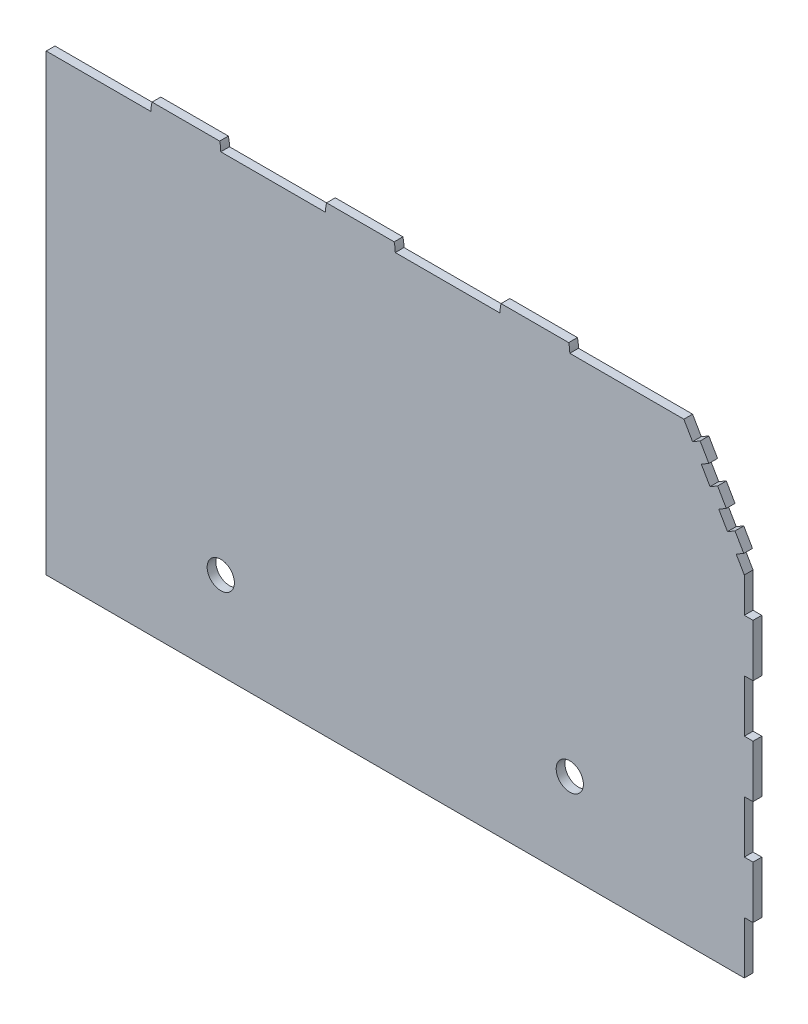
ISO-10303-21;
HEADER;
FILE_DESCRIPTION(('STEP AP214'),'2;1');
FILE_NAME('part.step','',(''),(''),'','','');
FILE_SCHEMA(('AUTOMOTIVE_DESIGN { 1 0 10303 214 1 1 1 1 }'));
ENDSEC;
DATA;
#1=APPLICATION_CONTEXT('core data for automotive mechanical design processes');
#2=APPLICATION_PROTOCOL_DEFINITION('international standard','automotive_design',2000,#1);
#3=PRODUCT_CONTEXT('',#1,'mechanical');
#4=PRODUCT('Part','Part','',(#3));
#5=PRODUCT_RELATED_PRODUCT_CATEGORY('part','',(#4));
#6=PRODUCT_DEFINITION_FORMATION('','',#4);
#7=PRODUCT_DEFINITION_CONTEXT('part definition',#1,'design');
#8=PRODUCT_DEFINITION('design','',#6,#7);
#9=PRODUCT_DEFINITION_SHAPE('','',#8);
#10=(LENGTH_UNIT() NAMED_UNIT(*) SI_UNIT(.MILLI.,.METRE.));
#11=(NAMED_UNIT(*) PLANE_ANGLE_UNIT() SI_UNIT($,.RADIAN.));
#12=(NAMED_UNIT(*) SI_UNIT($,.STERADIAN.) SOLID_ANGLE_UNIT());
#13=UNCERTAINTY_MEASURE_WITH_UNIT(LENGTH_MEASURE(1.E-05),#10,'distance_accuracy_value','');
#14=(GEOMETRIC_REPRESENTATION_CONTEXT(3) GLOBAL_UNCERTAINTY_ASSIGNED_CONTEXT((#13)) GLOBAL_UNIT_ASSIGNED_CONTEXT((#10,
#11,#12)) REPRESENTATION_CONTEXT('',''));
#15=CARTESIAN_POINT('',(0.,0.,0.));
#16=DIRECTION('',(0.,0.,1.));
#17=DIRECTION('',(1.,0.,0.));
#18=AXIS2_PLACEMENT_3D('',#15,#16,#17);
#19=CARTESIAN_POINT('',(50.8,165.1,3.175));
#20=DIRECTION('',(0.,0.,1.));
#21=DIRECTION('',(1.,0.,0.));
#22=AXIS2_PLACEMENT_3D('',#19,#20,#21);
#23=PLANE('',#22);
#24=CARTESIAN_POINT('',(63.5,31.75,3.175));
#25=DIRECTION('',(0.,0.,1.));
#26=DIRECTION('',(1.,0.,0.));
#27=AXIS2_PLACEMENT_3D('',#24,#25,#26);
#28=CIRCLE('',#27,4.953);
#29=CARTESIAN_POINT('',(68.453,31.75,3.175));
#30=VERTEX_POINT('',#29);
#31=EDGE_CURVE('E333',#30,#30,#28,.T.);
#32=ORIENTED_EDGE('',*,*,#31,.F.);
#33=EDGE_LOOP('',(#32));
#34=FACE_BOUND('',#33,.T.);
#35=DIRECTION('',(1.,0.,0.));
#36=VECTOR('',#35,1.);
#37=CARTESIAN_POINT('',(254.,0.,3.175));
#38=LINE('',#37,#36);
#39=CARTESIAN_POINT('',(0.,0.,3.175));
#40=VERTEX_POINT('',#39);
#41=CARTESIAN_POINT('',(254.,0.,3.175));
#42=VERTEX_POINT('',#41);
#43=EDGE_CURVE('E410',#40,#42,#38,.T.);
#44=ORIENTED_EDGE('',*,*,#43,.T.);
#45=DIRECTION('',(0.,1.,0.));
#46=VECTOR('',#45,1.);
#47=CARTESIAN_POINT('',(254.,19.05,3.175));
#48=LINE('',#47,#46);
#49=CARTESIAN_POINT('',(254.,19.05,3.175));
#50=VERTEX_POINT('',#49);
#51=EDGE_CURVE('E193',#42,#50,#48,.T.);
#52=ORIENTED_EDGE('',*,*,#51,.T.);
#53=DIRECTION('',(1.,0.,0.));
#54=VECTOR('',#53,1.);
#55=CARTESIAN_POINT('',(254.,19.05,3.175));
#56=LINE('',#55,#54);
#57=CARTESIAN_POINT('',(257.175,19.05,3.175));
#58=VERTEX_POINT('',#57);
#59=EDGE_CURVE('E524',#50,#58,#56,.T.);
#60=ORIENTED_EDGE('',*,*,#59,.T.);
#61=DIRECTION('',(0.,1.,0.));
#62=VECTOR('',#61,1.);
#63=CARTESIAN_POINT('',(257.175,19.05,3.175));
#64=LINE('',#63,#62);
#65=CARTESIAN_POINT('',(257.175,38.1,3.175));
#66=VERTEX_POINT('',#65);
#67=EDGE_CURVE('E543',#58,#66,#64,.T.);
#68=ORIENTED_EDGE('',*,*,#67,.T.);
#69=DIRECTION('',(-1.,0.,0.));
#70=VECTOR('',#69,1.);
#71=CARTESIAN_POINT('',(257.175,38.1,3.175));
#72=LINE('',#71,#70);
#73=CARTESIAN_POINT('',(254.,38.1,3.175));
#74=VERTEX_POINT('',#73);
#75=EDGE_CURVE('E540',#66,#74,#72,.T.);
#76=ORIENTED_EDGE('',*,*,#75,.T.);
#77=DIRECTION('',(0.,1.,0.));
#78=VECTOR('',#77,1.);
#79=CARTESIAN_POINT('',(254.,57.15,3.175));
#80=LINE('',#79,#78);
#81=CARTESIAN_POINT('',(254.,57.15,3.175));
#82=VERTEX_POINT('',#81);
#83=EDGE_CURVE('E542',#74,#82,#80,.T.);
#84=ORIENTED_EDGE('',*,*,#83,.T.);
#85=DIRECTION('',(1.,0.,0.));
#86=VECTOR('',#85,1.);
#87=CARTESIAN_POINT('',(254.,57.15,3.175));
#88=LINE('',#87,#86);
#89=CARTESIAN_POINT('',(257.175,57.15,3.175));
#90=VERTEX_POINT('',#89);
#91=EDGE_CURVE('E545',#82,#90,#88,.T.);
#92=ORIENTED_EDGE('',*,*,#91,.T.);
#93=DIRECTION('',(0.,1.,0.));
#94=VECTOR('',#93,1.);
#95=CARTESIAN_POINT('',(257.175,57.15,3.175));
#96=LINE('',#95,#94);
#97=CARTESIAN_POINT('',(257.175,76.2,3.175));
#98=VERTEX_POINT('',#97);
#99=EDGE_CURVE('E551',#90,#98,#96,.T.);
#100=ORIENTED_EDGE('',*,*,#99,.T.);
#101=DIRECTION('',(-1.,0.,0.));
#102=VECTOR('',#101,1.);
#103=CARTESIAN_POINT('',(257.175,76.2,3.175));
#104=LINE('',#103,#102);
#105=CARTESIAN_POINT('',(254.,76.2,3.175));
#106=VERTEX_POINT('',#105);
#107=EDGE_CURVE('E553',#98,#106,#104,.T.);
#108=ORIENTED_EDGE('',*,*,#107,.T.);
#109=DIRECTION('',(0.,1.,0.));
#110=VECTOR('',#109,1.);
#111=CARTESIAN_POINT('',(254.,95.25,3.175));
#112=LINE('',#111,#110);
#113=CARTESIAN_POINT('',(254.,95.25,3.175));
#114=VERTEX_POINT('',#113);
#115=EDGE_CURVE('E555',#106,#114,#112,.T.);
#116=ORIENTED_EDGE('',*,*,#115,.T.);
#117=DIRECTION('',(1.,0.,0.));
#118=VECTOR('',#117,1.);
#119=CARTESIAN_POINT('',(254.,95.25,3.175));
#120=LINE('',#119,#118);
#121=CARTESIAN_POINT('',(257.175,95.25,3.175));
#122=VERTEX_POINT('',#121);
#123=EDGE_CURVE('E557',#114,#122,#120,.T.);
#124=ORIENTED_EDGE('',*,*,#123,.T.);
#125=DIRECTION('',(0.,1.,0.));
#126=VECTOR('',#125,1.);
#127=CARTESIAN_POINT('',(257.175,95.25,3.175));
#128=LINE('',#127,#126);
#129=CARTESIAN_POINT('',(257.175,114.3,3.175));
#130=VERTEX_POINT('',#129);
#131=EDGE_CURVE('E559',#122,#130,#128,.T.);
#132=ORIENTED_EDGE('',*,*,#131,.T.);
#133=DIRECTION('',(-1.,0.,0.));
#134=VECTOR('',#133,1.);
#135=CARTESIAN_POINT('',(257.175,114.3,3.175));
#136=LINE('',#135,#134);
#137=CARTESIAN_POINT('',(254.,114.3,3.175));
#138=VERTEX_POINT('',#137);
#139=EDGE_CURVE('E561',#130,#138,#136,.T.);
#140=ORIENTED_EDGE('',*,*,#139,.T.);
#141=DIRECTION('',(0.,1.,0.));
#142=VECTOR('',#141,1.);
#143=CARTESIAN_POINT('',(254.,127.,3.175));
#144=LINE('',#143,#142);
#145=CARTESIAN_POINT('',(254.,127.,3.175));
#146=VERTEX_POINT('',#145);
#147=EDGE_CURVE('E563',#138,#146,#144,.T.);
#148=ORIENTED_EDGE('',*,*,#147,.T.);
#149=DIRECTION('',(-0.500000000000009,0.866025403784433,0.));
#150=VECTOR('',#149,1.);
#151=CARTESIAN_POINT('',(251.052954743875,132.104432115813,3.175));
#152=LINE('',#151,#150);
#153=CARTESIAN_POINT('',(251.052954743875,132.104432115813,3.175));
#154=VERTEX_POINT('',#153);
#155=EDGE_CURVE('E565',#146,#154,#152,.T.);
#156=ORIENTED_EDGE('',*,*,#155,.T.);
#157=DIRECTION('',(0.866025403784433,0.500000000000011,0.));
#158=VECTOR('',#157,1.);
#159=CARTESIAN_POINT('',(253.802585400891,133.691932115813,3.175));
#160=LINE('',#159,#158);
#161=CARTESIAN_POINT('',(253.802585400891,133.691932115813,3.175));
#162=VERTEX_POINT('',#161);
#163=EDGE_CURVE('E567',#154,#162,#160,.T.);
#164=ORIENTED_EDGE('',*,*,#163,.T.);
#165=DIRECTION('',(-0.499999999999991,0.866025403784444,0.));
#166=VECTOR('',#165,1.);
#167=CARTESIAN_POINT('',(250.627585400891,139.191193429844,3.175));
#168=LINE('',#167,#166);
#169=CARTESIAN_POINT('',(250.627585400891,139.191193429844,3.175));
#170=VERTEX_POINT('',#169);
#171=EDGE_CURVE('E569',#162,#170,#168,.T.);
#172=ORIENTED_EDGE('',*,*,#171,.T.);
#173=DIRECTION('',(-0.866025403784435,-0.500000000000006,0.));
#174=VECTOR('',#173,1.);
#175=CARTESIAN_POINT('',(247.877954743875,137.603693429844,3.175));
#176=LINE('',#175,#174);
#177=CARTESIAN_POINT('',(247.877954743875,137.603693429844,3.175));
#178=VERTEX_POINT('',#177);
#179=EDGE_CURVE('E571',#170,#178,#176,.T.);
#180=ORIENTED_EDGE('',*,*,#179,.T.);
#181=DIRECTION('',(-0.500000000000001,0.866025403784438,0.));
#182=VECTOR('',#181,1.);
#183=CARTESIAN_POINT('',(244.702954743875,143.102954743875,3.175));
#184=LINE('',#183,#182);
#185=CARTESIAN_POINT('',(244.702954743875,143.102954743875,3.175));
#186=VERTEX_POINT('',#185);
#187=EDGE_CURVE('E573',#178,#186,#184,.T.);
#188=ORIENTED_EDGE('',*,*,#187,.T.);
#189=DIRECTION('',(0.866025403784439,0.499999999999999,0.));
#190=VECTOR('',#189,1.);
#191=CARTESIAN_POINT('',(247.452585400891,144.690454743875,3.175));
#192=LINE('',#191,#190);
#193=CARTESIAN_POINT('',(247.452585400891,144.690454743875,3.175));
#194=VERTEX_POINT('',#193);
#195=EDGE_CURVE('E575',#186,#194,#192,.T.);
#196=ORIENTED_EDGE('',*,*,#195,.T.);
#197=DIRECTION('',(-0.499999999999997,0.86602540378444,0.));
#198=VECTOR('',#197,1.);
#199=CARTESIAN_POINT('',(244.277585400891,150.189716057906,3.175));
#200=LINE('',#199,#198);
#201=CARTESIAN_POINT('',(244.277585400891,150.189716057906,3.175));
#202=VERTEX_POINT('',#201);
#203=EDGE_CURVE('E577',#194,#202,#200,.T.);
#204=ORIENTED_EDGE('',*,*,#203,.T.);
#205=DIRECTION('',(-0.866025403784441,-0.499999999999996,0.));
#206=VECTOR('',#205,1.);
#207=CARTESIAN_POINT('',(241.527954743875,148.602216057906,3.175));
#208=LINE('',#207,#206);
#209=CARTESIAN_POINT('',(241.527954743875,148.602216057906,3.175));
#210=VERTEX_POINT('',#209);
#211=EDGE_CURVE('E579',#202,#210,#208,.T.);
#212=ORIENTED_EDGE('',*,*,#211,.T.);
#213=DIRECTION('',(-0.500000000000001,0.866025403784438,0.));
#214=VECTOR('',#213,1.);
#215=CARTESIAN_POINT('',(238.352954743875,154.101477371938,3.175));
#216=LINE('',#215,#214);
#217=CARTESIAN_POINT('',(238.352954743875,154.101477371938,3.175));
#218=VERTEX_POINT('',#217);
#219=EDGE_CURVE('E581',#210,#218,#216,.T.);
#220=ORIENTED_EDGE('',*,*,#219,.T.);
#221=DIRECTION('',(0.866025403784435,0.500000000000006,0.));
#222=VECTOR('',#221,1.);
#223=CARTESIAN_POINT('',(241.102585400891,155.688977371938,3.175));
#224=LINE('',#223,#222);
#225=CARTESIAN_POINT('',(241.102585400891,155.688977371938,3.175));
#226=VERTEX_POINT('',#225);
#227=EDGE_CURVE('E583',#218,#226,#224,.T.);
#228=ORIENTED_EDGE('',*,*,#227,.T.);
#229=DIRECTION('',(-0.500000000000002,0.866025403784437,0.));
#230=VECTOR('',#229,1.);
#231=CARTESIAN_POINT('',(237.927585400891,161.188238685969,3.175));
#232=LINE('',#231,#230);
#233=CARTESIAN_POINT('',(237.927585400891,161.188238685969,3.175));
#234=VERTEX_POINT('',#233);
#235=EDGE_CURVE('E585',#226,#234,#232,.T.);
#236=ORIENTED_EDGE('',*,*,#235,.T.);
#237=DIRECTION('',(-0.866025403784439,-0.499999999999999,0.));
#238=VECTOR('',#237,1.);
#239=CARTESIAN_POINT('',(235.177954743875,159.600738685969,3.175));
#240=LINE('',#239,#238);
#241=CARTESIAN_POINT('',(235.177954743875,159.600738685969,3.175));
#242=VERTEX_POINT('',#241);
#243=EDGE_CURVE('E587',#234,#242,#240,.T.);
#244=ORIENTED_EDGE('',*,*,#243,.T.);
#245=DIRECTION('',(-0.500000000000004,0.866025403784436,0.));
#246=VECTOR('',#245,1.);
#247=CARTESIAN_POINT('',(232.002954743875,165.1,3.175));
#248=LINE('',#247,#246);
#249=CARTESIAN_POINT('',(232.002954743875,165.1,3.175));
#250=VERTEX_POINT('',#249);
#251=EDGE_CURVE('E589',#242,#250,#248,.T.);
#252=ORIENTED_EDGE('',*,*,#251,.T.);
#253=DIRECTION('',(-1.,0.,0.));
#254=VECTOR('',#253,1.);
#255=CARTESIAN_POINT('',(190.5,165.1,3.175));
#256=LINE('',#255,#254);
#257=CARTESIAN_POINT('',(190.5,165.1,3.175));
#258=VERTEX_POINT('',#257);
#259=EDGE_CURVE('E591',#250,#258,#256,.T.);
#260=ORIENTED_EDGE('',*,*,#259,.T.);
#261=CARTESIAN_POINT('',(177.8,165.1,3.175));
#262=DIRECTION('',(0.,0.,1.));
#263=DIRECTION('',(1.,0.,0.));
#264=AXIS2_PLACEMENT_3D('',#261,#262,#263);
#265=CIRCLE('',#264,12.7);
#266=CARTESIAN_POINT('',(190.096722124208,168.275,3.175));
#267=VERTEX_POINT('',#266);
#268=EDGE_CURVE('E593',#258,#267,#265,.T.);
#269=ORIENTED_EDGE('',*,*,#268,.T.);
#270=DIRECTION('',(-1.,0.,0.));
#271=VECTOR('',#270,1.);
#272=CARTESIAN_POINT('',(165.503277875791,168.275,3.175));
#273=LINE('',#272,#271);
#274=CARTESIAN_POINT('',(165.503277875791,168.275,3.175));
#275=VERTEX_POINT('',#274);
#276=EDGE_CURVE('E595',#267,#275,#273,.T.);
#277=ORIENTED_EDGE('',*,*,#276,.T.);
#278=CARTESIAN_POINT('',(177.8,165.1,3.175));
#279=DIRECTION('',(0.,0.,1.));
#280=DIRECTION('',(1.,0.,0.));
#281=AXIS2_PLACEMENT_3D('',#278,#279,#280);
#282=CIRCLE('',#281,12.7);
#283=CARTESIAN_POINT('',(165.1,165.1,3.175));
#284=VERTEX_POINT('',#283);
#285=EDGE_CURVE('E597',#275,#284,#282,.T.);
#286=ORIENTED_EDGE('',*,*,#285,.T.);
#287=DIRECTION('',(-1.,0.,0.));
#288=VECTOR('',#287,1.);
#289=CARTESIAN_POINT('',(127.,165.1,3.175));
#290=LINE('',#289,#288);
#291=CARTESIAN_POINT('',(127.,165.1,3.175));
#292=VERTEX_POINT('',#291);
#293=EDGE_CURVE('E599',#284,#292,#290,.T.);
#294=ORIENTED_EDGE('',*,*,#293,.T.);
#295=CARTESIAN_POINT('',(114.3,165.1,3.175));
#296=DIRECTION('',(0.,0.,1.));
#297=DIRECTION('',(1.,0.,0.));
#298=AXIS2_PLACEMENT_3D('',#295,#296,#297);
#299=CIRCLE('',#298,12.7);
#300=CARTESIAN_POINT('',(126.596722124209,168.275,3.175));
#301=VERTEX_POINT('',#300);
#302=EDGE_CURVE('E601',#292,#301,#299,.T.);
#303=ORIENTED_EDGE('',*,*,#302,.T.);
#304=DIRECTION('',(-1.,0.,0.));
#305=VECTOR('',#304,1.);
#306=CARTESIAN_POINT('',(102.003277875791,168.275,3.175));
#307=LINE('',#306,#305);
#308=CARTESIAN_POINT('',(102.003277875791,168.275,3.175));
#309=VERTEX_POINT('',#308);
#310=EDGE_CURVE('E603',#301,#309,#307,.T.);
#311=ORIENTED_EDGE('',*,*,#310,.T.);
#312=CARTESIAN_POINT('',(114.3,165.1,3.175));
#313=DIRECTION('',(0.,0.,1.));
#314=DIRECTION('',(1.,0.,0.));
#315=AXIS2_PLACEMENT_3D('',#312,#313,#314);
#316=CIRCLE('',#315,12.7);
#317=CARTESIAN_POINT('',(101.6,165.1,3.175));
#318=VERTEX_POINT('',#317);
#319=EDGE_CURVE('E605',#309,#318,#316,.T.);
#320=ORIENTED_EDGE('',*,*,#319,.T.);
#321=DIRECTION('',(-1.,0.,0.));
#322=VECTOR('',#321,1.);
#323=CARTESIAN_POINT('',(63.5,165.1,3.175));
#324=LINE('',#323,#322);
#325=CARTESIAN_POINT('',(63.5,165.1,3.175));
#326=VERTEX_POINT('',#325);
#327=EDGE_CURVE('E607',#318,#326,#324,.T.);
#328=ORIENTED_EDGE('',*,*,#327,.T.);
#329=CARTESIAN_POINT('',(50.8,165.1,3.175));
#330=DIRECTION('',(0.,0.,1.));
#331=DIRECTION('',(1.,0.,0.));
#332=AXIS2_PLACEMENT_3D('',#329,#330,#331);
#333=CIRCLE('',#332,12.7);
#334=CARTESIAN_POINT('',(63.0967221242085,168.275,3.175));
#335=VERTEX_POINT('',#334);
#336=EDGE_CURVE('E609',#326,#335,#333,.T.);
#337=ORIENTED_EDGE('',*,*,#336,.T.);
#338=DIRECTION('',(-1.,0.,0.));
#339=VECTOR('',#338,1.);
#340=CARTESIAN_POINT('',(38.5032778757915,168.275,3.175));
#341=LINE('',#340,#339);
#342=CARTESIAN_POINT('',(38.5032778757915,168.275,3.175));
#343=VERTEX_POINT('',#342);
#344=EDGE_CURVE('E311',#335,#343,#341,.T.);
#345=ORIENTED_EDGE('',*,*,#344,.T.);
#346=CARTESIAN_POINT('',(50.8,165.1,3.175));
#347=DIRECTION('',(0.,0.,1.));
#348=DIRECTION('',(1.,0.,0.));
#349=AXIS2_PLACEMENT_3D('',#346,#347,#348);
#350=CIRCLE('',#349,12.7);
#351=CARTESIAN_POINT('',(38.1,165.1,3.175));
#352=VERTEX_POINT('',#351);
#353=EDGE_CURVE('E305',#343,#352,#350,.T.);
#354=ORIENTED_EDGE('',*,*,#353,.T.);
#355=DIRECTION('',(-1.,0.,0.));
#356=VECTOR('',#355,1.);
#357=CARTESIAN_POINT('',(0.,165.1,3.175));
#358=LINE('',#357,#356);
#359=CARTESIAN_POINT('',(0.,165.1,3.175));
#360=VERTEX_POINT('',#359);
#361=EDGE_CURVE('E309',#352,#360,#358,.T.);
#362=ORIENTED_EDGE('',*,*,#361,.T.);
#363=DIRECTION('',(0.,-1.,0.));
#364=VECTOR('',#363,1.);
#365=CARTESIAN_POINT('',(0.,0.,3.175));
#366=LINE('',#365,#364);
#367=EDGE_CURVE('E51',#360,#40,#366,.T.);
#368=ORIENTED_EDGE('',*,*,#367,.T.);
#369=EDGE_LOOP('',(#44,#52,#60,#68,#76,#84,#92,#100,#108,#116,#124,#132,#140,#148,#156,#164,
#172,#180,#188,#196,#204,#212,#220,#228,#236,#244,#252,#260,#269,#277,#286,#294,#303,#311,#320,
#328,#337,#345,#354,#362,#368));
#370=FACE_BOUND('',#369,.T.);
#371=CARTESIAN_POINT('',(190.5,31.75,3.175));
#372=DIRECTION('',(0.,0.,1.));
#373=DIRECTION('',(1.,0.,0.));
#374=AXIS2_PLACEMENT_3D('',#371,#372,#373);
#375=CIRCLE('',#374,4.95299999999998);
#376=CARTESIAN_POINT('',(195.453,31.75,3.175));
#377=VERTEX_POINT('',#376);
#378=EDGE_CURVE('E652',#377,#377,#375,.T.);
#379=ORIENTED_EDGE('',*,*,#378,.F.);
#380=EDGE_LOOP('',(#379));
#381=FACE_BOUND('',#380,.T.);
#382=ADVANCED_FACE('F34',(#34,#370,#381),#23,.T.);
#383=CARTESIAN_POINT('',(50.8,165.1,0.));
#384=DIRECTION('',(0.,0.,1.));
#385=DIRECTION('',(1.,0.,0.));
#386=AXIS2_PLACEMENT_3D('',#383,#384,#385);
#387=PLANE('',#386);
#388=CARTESIAN_POINT('',(63.5,31.75,0.));
#389=DIRECTION('',(0.,0.,1.));
#390=DIRECTION('',(1.,0.,0.));
#391=AXIS2_PLACEMENT_3D('',#388,#389,#390);
#392=CIRCLE('',#391,4.953);
#393=CARTESIAN_POINT('',(68.453,31.75,0.));
#394=VERTEX_POINT('',#393);
#395=EDGE_CURVE('E657',#394,#394,#392,.T.);
#396=ORIENTED_EDGE('',*,*,#395,.T.);
#397=EDGE_LOOP('',(#396));
#398=FACE_BOUND('',#397,.T.);
#399=DIRECTION('',(1.,0.,0.));
#400=VECTOR('',#399,1.);
#401=CARTESIAN_POINT('',(254.,0.,0.));
#402=LINE('',#401,#400);
#403=CARTESIAN_POINT('',(0.,0.,0.));
#404=VERTEX_POINT('',#403);
#405=CARTESIAN_POINT('',(254.,0.,0.));
#406=VERTEX_POINT('',#405);
#407=EDGE_CURVE('E329',#404,#406,#402,.T.);
#408=ORIENTED_EDGE('',*,*,#407,.F.);
#409=DIRECTION('',(0.,-1.,0.));
#410=VECTOR('',#409,1.);
#411=CARTESIAN_POINT('',(0.,0.,0.));
#412=LINE('',#411,#410);
#413=CARTESIAN_POINT('',(0.,165.1,0.));
#414=VERTEX_POINT('',#413);
#415=EDGE_CURVE('E185',#414,#404,#412,.T.);
#416=ORIENTED_EDGE('',*,*,#415,.F.);
#417=DIRECTION('',(-1.,0.,0.));
#418=VECTOR('',#417,1.);
#419=CARTESIAN_POINT('',(0.,165.1,0.));
#420=LINE('',#419,#418);
#421=CARTESIAN_POINT('',(38.1,165.1,0.));
#422=VERTEX_POINT('',#421);
#423=EDGE_CURVE('E179',#422,#414,#420,.T.);
#424=ORIENTED_EDGE('',*,*,#423,.F.);
#425=CARTESIAN_POINT('',(50.8,165.1,0.));
#426=DIRECTION('',(0.,0.,1.));
#427=DIRECTION('',(1.,0.,0.));
#428=AXIS2_PLACEMENT_3D('',#425,#426,#427);
#429=CIRCLE('',#428,12.7);
#430=CARTESIAN_POINT('',(38.5032778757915,168.275,0.));
#431=VERTEX_POINT('',#430);
#432=EDGE_CURVE('E319',#431,#422,#429,.T.);
#433=ORIENTED_EDGE('',*,*,#432,.F.);
#434=DIRECTION('',(-1.,0.,0.));
#435=VECTOR('',#434,1.);
#436=CARTESIAN_POINT('',(38.5032778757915,168.275,0.));
#437=LINE('',#436,#435);
#438=CARTESIAN_POINT('',(63.0967221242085,168.275,0.));
#439=VERTEX_POINT('',#438);
#440=EDGE_CURVE('E405',#439,#431,#437,.T.);
#441=ORIENTED_EDGE('',*,*,#440,.F.);
#442=CARTESIAN_POINT('',(50.8,165.1,0.));
#443=DIRECTION('',(0.,0.,1.));
#444=DIRECTION('',(1.,0.,0.));
#445=AXIS2_PLACEMENT_3D('',#442,#443,#444);
#446=CIRCLE('',#445,12.7);
#447=CARTESIAN_POINT('',(63.5,165.1,0.));
#448=VERTEX_POINT('',#447);
#449=EDGE_CURVE('E403',#448,#439,#446,.T.);
#450=ORIENTED_EDGE('',*,*,#449,.F.);
#451=DIRECTION('',(-1.,0.,0.));
#452=VECTOR('',#451,1.);
#453=CARTESIAN_POINT('',(63.5,165.1,0.));
#454=LINE('',#453,#452);
#455=CARTESIAN_POINT('',(101.6,165.1,0.));
#456=VERTEX_POINT('',#455);
#457=EDGE_CURVE('E401',#456,#448,#454,.T.);
#458=ORIENTED_EDGE('',*,*,#457,.F.);
#459=CARTESIAN_POINT('',(114.3,165.1,0.));
#460=DIRECTION('',(0.,0.,1.));
#461=DIRECTION('',(1.,0.,0.));
#462=AXIS2_PLACEMENT_3D('',#459,#460,#461);
#463=CIRCLE('',#462,12.7);
#464=CARTESIAN_POINT('',(102.003277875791,168.275,0.));
#465=VERTEX_POINT('',#464);
#466=EDGE_CURVE('E399',#465,#456,#463,.T.);
#467=ORIENTED_EDGE('',*,*,#466,.F.);
#468=DIRECTION('',(-1.,0.,0.));
#469=VECTOR('',#468,1.);
#470=CARTESIAN_POINT('',(102.003277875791,168.275,0.));
#471=LINE('',#470,#469);
#472=CARTESIAN_POINT('',(126.596722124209,168.275,0.));
#473=VERTEX_POINT('',#472);
#474=EDGE_CURVE('E397',#473,#465,#471,.T.);
#475=ORIENTED_EDGE('',*,*,#474,.F.);
#476=CARTESIAN_POINT('',(114.3,165.1,0.));
#477=DIRECTION('',(0.,0.,1.));
#478=DIRECTION('',(1.,0.,0.));
#479=AXIS2_PLACEMENT_3D('',#476,#477,#478);
#480=CIRCLE('',#479,12.7);
#481=CARTESIAN_POINT('',(127.,165.1,0.));
#482=VERTEX_POINT('',#481);
#483=EDGE_CURVE('E395',#482,#473,#480,.T.);
#484=ORIENTED_EDGE('',*,*,#483,.F.);
#485=DIRECTION('',(-1.,0.,0.));
#486=VECTOR('',#485,1.);
#487=CARTESIAN_POINT('',(127.,165.1,0.));
#488=LINE('',#487,#486);
#489=CARTESIAN_POINT('',(165.1,165.1,0.));
#490=VERTEX_POINT('',#489);
#491=EDGE_CURVE('E393',#490,#482,#488,.T.);
#492=ORIENTED_EDGE('',*,*,#491,.F.);
#493=CARTESIAN_POINT('',(177.8,165.1,0.));
#494=DIRECTION('',(0.,0.,1.));
#495=DIRECTION('',(1.,0.,0.));
#496=AXIS2_PLACEMENT_3D('',#493,#494,#495);
#497=CIRCLE('',#496,12.7);
#498=CARTESIAN_POINT('',(165.503277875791,168.275,0.));
#499=VERTEX_POINT('',#498);
#500=EDGE_CURVE('E391',#499,#490,#497,.T.);
#501=ORIENTED_EDGE('',*,*,#500,.F.);
#502=DIRECTION('',(-1.,0.,0.));
#503=VECTOR('',#502,1.);
#504=CARTESIAN_POINT('',(165.503277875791,168.275,0.));
#505=LINE('',#504,#503);
#506=CARTESIAN_POINT('',(190.096722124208,168.275,0.));
#507=VERTEX_POINT('',#506);
#508=EDGE_CURVE('E389',#507,#499,#505,.T.);
#509=ORIENTED_EDGE('',*,*,#508,.F.);
#510=CARTESIAN_POINT('',(177.8,165.1,0.));
#511=DIRECTION('',(0.,0.,1.));
#512=DIRECTION('',(1.,0.,0.));
#513=AXIS2_PLACEMENT_3D('',#510,#511,#512);
#514=CIRCLE('',#513,12.7);
#515=CARTESIAN_POINT('',(190.5,165.1,0.));
#516=VERTEX_POINT('',#515);
#517=EDGE_CURVE('E387',#516,#507,#514,.T.);
#518=ORIENTED_EDGE('',*,*,#517,.F.);
#519=DIRECTION('',(-1.,0.,0.));
#520=VECTOR('',#519,1.);
#521=CARTESIAN_POINT('',(190.5,165.1,0.));
#522=LINE('',#521,#520);
#523=CARTESIAN_POINT('',(232.002954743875,165.1,0.));
#524=VERTEX_POINT('',#523);
#525=EDGE_CURVE('E385',#524,#516,#522,.T.);
#526=ORIENTED_EDGE('',*,*,#525,.F.);
#527=DIRECTION('',(-0.500000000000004,0.866025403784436,0.));
#528=VECTOR('',#527,1.);
#529=CARTESIAN_POINT('',(232.002954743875,165.1,0.));
#530=LINE('',#529,#528);
#531=CARTESIAN_POINT('',(235.177954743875,159.600738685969,0.));
#532=VERTEX_POINT('',#531);
#533=EDGE_CURVE('E383',#532,#524,#530,.T.);
#534=ORIENTED_EDGE('',*,*,#533,.F.);
#535=DIRECTION('',(-0.866025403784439,-0.499999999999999,0.));
#536=VECTOR('',#535,1.);
#537=CARTESIAN_POINT('',(235.177954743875,159.600738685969,0.));
#538=LINE('',#537,#536);
#539=CARTESIAN_POINT('',(237.927585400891,161.188238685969,0.));
#540=VERTEX_POINT('',#539);
#541=EDGE_CURVE('E381',#540,#532,#538,.T.);
#542=ORIENTED_EDGE('',*,*,#541,.F.);
#543=DIRECTION('',(-0.500000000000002,0.866025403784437,0.));
#544=VECTOR('',#543,1.);
#545=CARTESIAN_POINT('',(237.927585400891,161.188238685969,0.));
#546=LINE('',#545,#544);
#547=CARTESIAN_POINT('',(241.102585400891,155.688977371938,0.));
#548=VERTEX_POINT('',#547);
#549=EDGE_CURVE('E379',#548,#540,#546,.T.);
#550=ORIENTED_EDGE('',*,*,#549,.F.);
#551=DIRECTION('',(0.866025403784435,0.500000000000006,0.));
#552=VECTOR('',#551,1.);
#553=CARTESIAN_POINT('',(241.102585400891,155.688977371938,0.));
#554=LINE('',#553,#552);
#555=CARTESIAN_POINT('',(238.352954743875,154.101477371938,0.));
#556=VERTEX_POINT('',#555);
#557=EDGE_CURVE('E377',#556,#548,#554,.T.);
#558=ORIENTED_EDGE('',*,*,#557,.F.);
#559=DIRECTION('',(-0.500000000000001,0.866025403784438,0.));
#560=VECTOR('',#559,1.);
#561=CARTESIAN_POINT('',(238.352954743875,154.101477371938,0.));
#562=LINE('',#561,#560);
#563=CARTESIAN_POINT('',(241.527954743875,148.602216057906,0.));
#564=VERTEX_POINT('',#563);
#565=EDGE_CURVE('E375',#564,#556,#562,.T.);
#566=ORIENTED_EDGE('',*,*,#565,.F.);
#567=DIRECTION('',(-0.866025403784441,-0.499999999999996,0.));
#568=VECTOR('',#567,1.);
#569=CARTESIAN_POINT('',(241.527954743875,148.602216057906,0.));
#570=LINE('',#569,#568);
#571=CARTESIAN_POINT('',(244.277585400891,150.189716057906,0.));
#572=VERTEX_POINT('',#571);
#573=EDGE_CURVE('E373',#572,#564,#570,.T.);
#574=ORIENTED_EDGE('',*,*,#573,.F.);
#575=DIRECTION('',(-0.499999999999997,0.86602540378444,0.));
#576=VECTOR('',#575,1.);
#577=CARTESIAN_POINT('',(244.277585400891,150.189716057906,0.));
#578=LINE('',#577,#576);
#579=CARTESIAN_POINT('',(247.452585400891,144.690454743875,0.));
#580=VERTEX_POINT('',#579);
#581=EDGE_CURVE('E371',#580,#572,#578,.T.);
#582=ORIENTED_EDGE('',*,*,#581,.F.);
#583=DIRECTION('',(0.866025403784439,0.499999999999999,0.));
#584=VECTOR('',#583,1.);
#585=CARTESIAN_POINT('',(247.452585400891,144.690454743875,0.));
#586=LINE('',#585,#584);
#587=CARTESIAN_POINT('',(244.702954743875,143.102954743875,0.));
#588=VERTEX_POINT('',#587);
#589=EDGE_CURVE('E369',#588,#580,#586,.T.);
#590=ORIENTED_EDGE('',*,*,#589,.F.);
#591=DIRECTION('',(-0.500000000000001,0.866025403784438,0.));
#592=VECTOR('',#591,1.);
#593=CARTESIAN_POINT('',(244.702954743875,143.102954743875,0.));
#594=LINE('',#593,#592);
#595=CARTESIAN_POINT('',(247.877954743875,137.603693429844,0.));
#596=VERTEX_POINT('',#595);
#597=EDGE_CURVE('E367',#596,#588,#594,.T.);
#598=ORIENTED_EDGE('',*,*,#597,.F.);
#599=DIRECTION('',(-0.866025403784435,-0.500000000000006,0.));
#600=VECTOR('',#599,1.);
#601=CARTESIAN_POINT('',(247.877954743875,137.603693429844,0.));
#602=LINE('',#601,#600);
#603=CARTESIAN_POINT('',(250.627585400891,139.191193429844,0.));
#604=VERTEX_POINT('',#603);
#605=EDGE_CURVE('E365',#604,#596,#602,.T.);
#606=ORIENTED_EDGE('',*,*,#605,.F.);
#607=DIRECTION('',(-0.499999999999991,0.866025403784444,0.));
#608=VECTOR('',#607,1.);
#609=CARTESIAN_POINT('',(250.627585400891,139.191193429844,0.));
#610=LINE('',#609,#608);
#611=CARTESIAN_POINT('',(253.802585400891,133.691932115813,0.));
#612=VERTEX_POINT('',#611);
#613=EDGE_CURVE('E363',#612,#604,#610,.T.);
#614=ORIENTED_EDGE('',*,*,#613,.F.);
#615=DIRECTION('',(0.866025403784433,0.500000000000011,0.));
#616=VECTOR('',#615,1.);
#617=CARTESIAN_POINT('',(253.802585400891,133.691932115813,0.));
#618=LINE('',#617,#616);
#619=CARTESIAN_POINT('',(251.052954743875,132.104432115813,0.));
#620=VERTEX_POINT('',#619);
#621=EDGE_CURVE('E361',#620,#612,#618,.T.);
#622=ORIENTED_EDGE('',*,*,#621,.F.);
#623=DIRECTION('',(-0.500000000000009,0.866025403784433,0.));
#624=VECTOR('',#623,1.);
#625=CARTESIAN_POINT('',(251.052954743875,132.104432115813,0.));
#626=LINE('',#625,#624);
#627=CARTESIAN_POINT('',(254.,127.,0.));
#628=VERTEX_POINT('',#627);
#629=EDGE_CURVE('E359',#628,#620,#626,.T.);
#630=ORIENTED_EDGE('',*,*,#629,.F.);
#631=DIRECTION('',(0.,1.,0.));
#632=VECTOR('',#631,1.);
#633=CARTESIAN_POINT('',(254.,127.,0.));
#634=LINE('',#633,#632);
#635=CARTESIAN_POINT('',(254.,114.3,0.));
#636=VERTEX_POINT('',#635);
#637=EDGE_CURVE('E357',#636,#628,#634,.T.);
#638=ORIENTED_EDGE('',*,*,#637,.F.);
#639=DIRECTION('',(-1.,0.,0.));
#640=VECTOR('',#639,1.);
#641=CARTESIAN_POINT('',(257.175,114.3,0.));
#642=LINE('',#641,#640);
#643=CARTESIAN_POINT('',(257.175,114.3,0.));
#644=VERTEX_POINT('',#643);
#645=EDGE_CURVE('E355',#644,#636,#642,.T.);
#646=ORIENTED_EDGE('',*,*,#645,.F.);
#647=DIRECTION('',(0.,1.,0.));
#648=VECTOR('',#647,1.);
#649=CARTESIAN_POINT('',(257.175,95.25,0.));
#650=LINE('',#649,#648);
#651=CARTESIAN_POINT('',(257.175,95.25,0.));
#652=VERTEX_POINT('',#651);
#653=EDGE_CURVE('E353',#652,#644,#650,.T.);
#654=ORIENTED_EDGE('',*,*,#653,.F.);
#655=DIRECTION('',(1.,0.,0.));
#656=VECTOR('',#655,1.);
#657=CARTESIAN_POINT('',(254.,95.25,0.));
#658=LINE('',#657,#656);
#659=CARTESIAN_POINT('',(254.,95.25,0.));
#660=VERTEX_POINT('',#659);
#661=EDGE_CURVE('E351',#660,#652,#658,.T.);
#662=ORIENTED_EDGE('',*,*,#661,.F.);
#663=DIRECTION('',(0.,1.,0.));
#664=VECTOR('',#663,1.);
#665=CARTESIAN_POINT('',(254.,95.25,0.));
#666=LINE('',#665,#664);
#667=CARTESIAN_POINT('',(254.,76.2,0.));
#668=VERTEX_POINT('',#667);
#669=EDGE_CURVE('E349',#668,#660,#666,.T.);
#670=ORIENTED_EDGE('',*,*,#669,.F.);
#671=DIRECTION('',(-1.,0.,0.));
#672=VECTOR('',#671,1.);
#673=CARTESIAN_POINT('',(257.175,76.2,0.));
#674=LINE('',#673,#672);
#675=CARTESIAN_POINT('',(257.175,76.2,0.));
#676=VERTEX_POINT('',#675);
#677=EDGE_CURVE('E347',#676,#668,#674,.T.);
#678=ORIENTED_EDGE('',*,*,#677,.F.);
#679=DIRECTION('',(0.,1.,0.));
#680=VECTOR('',#679,1.);
#681=CARTESIAN_POINT('',(257.175,57.15,0.));
#682=LINE('',#681,#680);
#683=CARTESIAN_POINT('',(257.175,57.15,0.));
#684=VERTEX_POINT('',#683);
#685=EDGE_CURVE('E345',#684,#676,#682,.T.);
#686=ORIENTED_EDGE('',*,*,#685,.F.);
#687=DIRECTION('',(1.,0.,0.));
#688=VECTOR('',#687,1.);
#689=CARTESIAN_POINT('',(254.,57.15,0.));
#690=LINE('',#689,#688);
#691=CARTESIAN_POINT('',(254.,57.15,0.));
#692=VERTEX_POINT('',#691);
#693=EDGE_CURVE('E343',#692,#684,#690,.T.);
#694=ORIENTED_EDGE('',*,*,#693,.F.);
#695=DIRECTION('',(0.,1.,0.));
#696=VECTOR('',#695,1.);
#697=CARTESIAN_POINT('',(254.,57.15,0.));
#698=LINE('',#697,#696);
#699=CARTESIAN_POINT('',(254.,38.1,0.));
#700=VERTEX_POINT('',#699);
#701=EDGE_CURVE('E341',#700,#692,#698,.T.);
#702=ORIENTED_EDGE('',*,*,#701,.F.);
#703=DIRECTION('',(-1.,0.,0.));
#704=VECTOR('',#703,1.);
#705=CARTESIAN_POINT('',(257.175,38.1,0.));
#706=LINE('',#705,#704);
#707=CARTESIAN_POINT('',(257.175,38.1,0.));
#708=VERTEX_POINT('',#707);
#709=EDGE_CURVE('E339',#708,#700,#706,.T.);
#710=ORIENTED_EDGE('',*,*,#709,.F.);
#711=DIRECTION('',(0.,1.,0.));
#712=VECTOR('',#711,1.);
#713=CARTESIAN_POINT('',(257.175,19.05,0.));
#714=LINE('',#713,#712);
#715=CARTESIAN_POINT('',(257.175,19.05,0.));
#716=VERTEX_POINT('',#715);
#717=EDGE_CURVE('E337',#716,#708,#714,.T.);
#718=ORIENTED_EDGE('',*,*,#717,.F.);
#719=DIRECTION('',(1.,0.,0.));
#720=VECTOR('',#719,1.);
#721=CARTESIAN_POINT('',(254.,19.05,0.));
#722=LINE('',#721,#720);
#723=CARTESIAN_POINT('',(254.,19.05,0.));
#724=VERTEX_POINT('',#723);
#725=EDGE_CURVE('E335',#724,#716,#722,.T.);
#726=ORIENTED_EDGE('',*,*,#725,.F.);
#727=DIRECTION('',(0.,1.,0.));
#728=VECTOR('',#727,1.);
#729=CARTESIAN_POINT('',(254.,19.05,0.));
#730=LINE('',#729,#728);
#731=EDGE_CURVE('E332',#406,#724,#730,.T.);
#732=ORIENTED_EDGE('',*,*,#731,.F.);
#733=EDGE_LOOP('',(#408,#416,#424,#433,#441,#450,#458,#467,#475,#484,#492,#501,#509,#518,#526,
#534,#542,#550,#558,#566,#574,#582,#590,#598,#606,#614,#622,#630,#638,#646,#654,#662,#670,#678,
#686,#694,#702,#710,#718,#726,#732));
#734=FACE_BOUND('',#733,.T.);
#735=CARTESIAN_POINT('',(190.5,31.75,0.));
#736=DIRECTION('',(0.,0.,1.));
#737=DIRECTION('',(1.,0.,0.));
#738=AXIS2_PLACEMENT_3D('',#735,#736,#737);
#739=CIRCLE('',#738,4.95299999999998);
#740=CARTESIAN_POINT('',(195.453,31.75,0.));
#741=VERTEX_POINT('',#740);
#742=EDGE_CURVE('E655',#741,#741,#739,.T.);
#743=ORIENTED_EDGE('',*,*,#742,.T.);
#744=EDGE_LOOP('',(#743));
#745=FACE_BOUND('',#744,.T.);
#746=ADVANCED_FACE('F528',(#398,#734,#745),#387,.F.);
#747=CARTESIAN_POINT('',(254.,0.,3.175));
#748=DIRECTION('',(0.,1.,0.));
#749=DIRECTION('',(0.,0.,1.));
#750=AXIS2_PLACEMENT_3D('',#747,#748,#749);
#751=PLANE('',#750);
#752=ORIENTED_EDGE('',*,*,#407,.T.);
#753=DIRECTION('',(0.,0.,-1.));
#754=VECTOR('',#753,1.);
#755=CARTESIAN_POINT('',(254.,0.,3.175));
#756=LINE('',#755,#754);
#757=EDGE_CURVE('E11',#42,#406,#756,.T.);
#758=ORIENTED_EDGE('',*,*,#757,.F.);
#759=ORIENTED_EDGE('',*,*,#43,.F.);
#760=DIRECTION('',(0.,0.,-1.));
#761=VECTOR('',#760,1.);
#762=CARTESIAN_POINT('',(0.,0.,3.175));
#763=LINE('',#762,#761);
#764=EDGE_CURVE('E325',#40,#404,#763,.T.);
#765=ORIENTED_EDGE('',*,*,#764,.T.);
#766=EDGE_LOOP('',(#752,#758,#759,#765));
#767=FACE_BOUND('',#766,.T.);
#768=ADVANCED_FACE('F36',(#767),#751,.F.);
#769=CARTESIAN_POINT('',(254.,19.05,3.175));
#770=DIRECTION('',(-1.,0.,0.));
#771=DIRECTION('',(0.,0.,1.));
#772=AXIS2_PLACEMENT_3D('',#769,#770,#771);
#773=PLANE('',#772);
#774=ORIENTED_EDGE('',*,*,#731,.T.);
#775=DIRECTION('',(0.,0.,-1.));
#776=VECTOR('',#775,1.);
#777=CARTESIAN_POINT('',(254.,19.05,3.175));
#778=LINE('',#777,#776);
#779=EDGE_CURVE('E43',#50,#724,#778,.T.);
#780=ORIENTED_EDGE('',*,*,#779,.F.);
#781=ORIENTED_EDGE('',*,*,#51,.F.);
#782=ORIENTED_EDGE('',*,*,#757,.T.);
#783=EDGE_LOOP('',(#774,#780,#781,#782));
#784=FACE_BOUND('',#783,.T.);
#785=ADVANCED_FACE('F1040',(#784),#773,.F.);
#786=CARTESIAN_POINT('',(254.,19.05,3.175));
#787=DIRECTION('',(0.,1.,0.));
#788=DIRECTION('',(0.,0.,1.));
#789=AXIS2_PLACEMENT_3D('',#786,#787,#788);
#790=PLANE('',#789);
#791=ORIENTED_EDGE('',*,*,#725,.T.);
#792=DIRECTION('',(0.,0.,-1.));
#793=VECTOR('',#792,1.);
#794=CARTESIAN_POINT('',(257.175,19.05,3.175));
#795=LINE('',#794,#793);
#796=EDGE_CURVE('E516',#58,#716,#795,.T.);
#797=ORIENTED_EDGE('',*,*,#796,.F.);
#798=ORIENTED_EDGE('',*,*,#59,.F.);
#799=ORIENTED_EDGE('',*,*,#779,.T.);
#800=EDGE_LOOP('',(#791,#797,#798,#799));
#801=FACE_BOUND('',#800,.T.);
#802=ADVANCED_FACE('F522',(#801),#790,.F.);
#803=CARTESIAN_POINT('',(257.175,19.05,3.175));
#804=DIRECTION('',(-1.,0.,0.));
#805=DIRECTION('',(0.,0.,1.));
#806=AXIS2_PLACEMENT_3D('',#803,#804,#805);
#807=PLANE('',#806);
#808=ORIENTED_EDGE('',*,*,#717,.T.);
#809=DIRECTION('',(0.,0.,-1.));
#810=VECTOR('',#809,1.);
#811=CARTESIAN_POINT('',(257.175,38.1,3.175));
#812=LINE('',#811,#810);
#813=EDGE_CURVE('E513',#66,#708,#812,.T.);
#814=ORIENTED_EDGE('',*,*,#813,.F.);
#815=ORIENTED_EDGE('',*,*,#67,.F.);
#816=ORIENTED_EDGE('',*,*,#796,.T.);
#817=EDGE_LOOP('',(#808,#814,#815,#816));
#818=FACE_BOUND('',#817,.T.);
#819=ADVANCED_FACE('F534',(#818),#807,.F.);
#820=CARTESIAN_POINT('',(257.175,38.1,3.175));
#821=DIRECTION('',(0.,-1.,0.));
#822=DIRECTION('',(1.,0.,0.));
#823=AXIS2_PLACEMENT_3D('',#820,#821,#822);
#824=PLANE('',#823);
#825=ORIENTED_EDGE('',*,*,#709,.T.);
#826=DIRECTION('',(0.,0.,-1.));
#827=VECTOR('',#826,1.);
#828=CARTESIAN_POINT('',(254.,38.1,3.175));
#829=LINE('',#828,#827);
#830=EDGE_CURVE('E510',#74,#700,#829,.T.);
#831=ORIENTED_EDGE('',*,*,#830,.F.);
#832=ORIENTED_EDGE('',*,*,#75,.F.);
#833=ORIENTED_EDGE('',*,*,#813,.T.);
#834=EDGE_LOOP('',(#825,#831,#832,#833));
#835=FACE_BOUND('',#834,.T.);
#836=ADVANCED_FACE('F538',(#835),#824,.F.);
#837=CARTESIAN_POINT('',(254.,57.15,3.175));
#838=DIRECTION('',(-1.,0.,0.));
#839=DIRECTION('',(0.,0.,1.));
#840=AXIS2_PLACEMENT_3D('',#837,#838,#839);
#841=PLANE('',#840);
#842=ORIENTED_EDGE('',*,*,#701,.T.);
#843=DIRECTION('',(0.,0.,-1.));
#844=VECTOR('',#843,1.);
#845=CARTESIAN_POINT('',(254.,57.15,3.175));
#846=LINE('',#845,#844);
#847=EDGE_CURVE('E507',#82,#692,#846,.T.);
#848=ORIENTED_EDGE('',*,*,#847,.F.);
#849=ORIENTED_EDGE('',*,*,#83,.F.);
#850=ORIENTED_EDGE('',*,*,#830,.T.);
#851=EDGE_LOOP('',(#842,#848,#849,#850));
#852=FACE_BOUND('',#851,.T.);
#853=ADVANCED_FACE('F1005',(#852),#841,.F.);
#854=CARTESIAN_POINT('',(254.,57.15,3.175));
#855=DIRECTION('',(0.,1.,0.));
#856=DIRECTION('',(0.,0.,1.));
#857=AXIS2_PLACEMENT_3D('',#854,#855,#856);
#858=PLANE('',#857);
#859=ORIENTED_EDGE('',*,*,#693,.T.);
#860=DIRECTION('',(0.,0.,-1.));
#861=VECTOR('',#860,1.);
#862=CARTESIAN_POINT('',(257.175,57.15,3.175));
#863=LINE('',#862,#861);
#864=EDGE_CURVE('E504',#90,#684,#863,.T.);
#865=ORIENTED_EDGE('',*,*,#864,.F.);
#866=ORIENTED_EDGE('',*,*,#91,.F.);
#867=ORIENTED_EDGE('',*,*,#847,.T.);
#868=EDGE_LOOP('',(#859,#865,#866,#867));
#869=FACE_BOUND('',#868,.T.);
#870=ADVANCED_FACE('F995',(#869),#858,.F.);
#871=CARTESIAN_POINT('',(257.175,57.15,3.175));
#872=DIRECTION('',(-1.,0.,0.));
#873=DIRECTION('',(0.,0.,1.));
#874=AXIS2_PLACEMENT_3D('',#871,#872,#873);
#875=PLANE('',#874);
#876=ORIENTED_EDGE('',*,*,#685,.T.);
#877=DIRECTION('',(0.,0.,-1.));
#878=VECTOR('',#877,1.);
#879=CARTESIAN_POINT('',(257.175,76.2,3.175));
#880=LINE('',#879,#878);
#881=EDGE_CURVE('E501',#98,#676,#880,.T.);
#882=ORIENTED_EDGE('',*,*,#881,.F.);
#883=ORIENTED_EDGE('',*,*,#99,.F.);
#884=ORIENTED_EDGE('',*,*,#864,.T.);
#885=EDGE_LOOP('',(#876,#882,#883,#884));
#886=FACE_BOUND('',#885,.T.);
#887=ADVANCED_FACE('F985',(#886),#875,.F.);
#888=CARTESIAN_POINT('',(257.175,76.2,3.175));
#889=DIRECTION('',(0.,-1.,0.));
#890=DIRECTION('',(0.,0.,-1.));
#891=AXIS2_PLACEMENT_3D('',#888,#889,#890);
#892=PLANE('',#891);
#893=ORIENTED_EDGE('',*,*,#677,.T.);
#894=DIRECTION('',(0.,0.,-1.));
#895=VECTOR('',#894,1.);
#896=CARTESIAN_POINT('',(254.,76.2,3.175));
#897=LINE('',#896,#895);
#898=EDGE_CURVE('E498',#106,#668,#897,.T.);
#899=ORIENTED_EDGE('',*,*,#898,.F.);
#900=ORIENTED_EDGE('',*,*,#107,.F.);
#901=ORIENTED_EDGE('',*,*,#881,.T.);
#902=EDGE_LOOP('',(#893,#899,#900,#901));
#903=FACE_BOUND('',#902,.T.);
#904=ADVANCED_FACE('F975',(#903),#892,.F.);
#905=CARTESIAN_POINT('',(254.,95.25,3.175));
#906=DIRECTION('',(-1.,0.,0.));
#907=DIRECTION('',(0.,0.,1.));
#908=AXIS2_PLACEMENT_3D('',#905,#906,#907);
#909=PLANE('',#908);
#910=ORIENTED_EDGE('',*,*,#669,.T.);
#911=DIRECTION('',(0.,0.,-1.));
#912=VECTOR('',#911,1.);
#913=CARTESIAN_POINT('',(254.,95.25,3.175));
#914=LINE('',#913,#912);
#915=EDGE_CURVE('E495',#114,#660,#914,.T.);
#916=ORIENTED_EDGE('',*,*,#915,.F.);
#917=ORIENTED_EDGE('',*,*,#115,.F.);
#918=ORIENTED_EDGE('',*,*,#898,.T.);
#919=EDGE_LOOP('',(#910,#916,#917,#918));
#920=FACE_BOUND('',#919,.T.);
#921=ADVANCED_FACE('F965',(#920),#909,.F.);
#922=CARTESIAN_POINT('',(254.,95.25,3.175));
#923=DIRECTION('',(0.,1.,0.));
#924=DIRECTION('',(0.,0.,1.));
#925=AXIS2_PLACEMENT_3D('',#922,#923,#924);
#926=PLANE('',#925);
#927=ORIENTED_EDGE('',*,*,#661,.T.);
#928=DIRECTION('',(0.,0.,-1.));
#929=VECTOR('',#928,1.);
#930=CARTESIAN_POINT('',(257.175,95.25,3.175));
#931=LINE('',#930,#929);
#932=EDGE_CURVE('E492',#122,#652,#931,.T.);
#933=ORIENTED_EDGE('',*,*,#932,.F.);
#934=ORIENTED_EDGE('',*,*,#123,.F.);
#935=ORIENTED_EDGE('',*,*,#915,.T.);
#936=EDGE_LOOP('',(#927,#933,#934,#935));
#937=FACE_BOUND('',#936,.T.);
#938=ADVANCED_FACE('F955',(#937),#926,.F.);
#939=CARTESIAN_POINT('',(257.175,95.25,3.175));
#940=DIRECTION('',(-1.,0.,0.));
#941=DIRECTION('',(0.,0.,1.));
#942=AXIS2_PLACEMENT_3D('',#939,#940,#941);
#943=PLANE('',#942);
#944=ORIENTED_EDGE('',*,*,#653,.T.);
#945=DIRECTION('',(0.,0.,-1.));
#946=VECTOR('',#945,1.);
#947=CARTESIAN_POINT('',(257.175,114.3,3.175));
#948=LINE('',#947,#946);
#949=EDGE_CURVE('E489',#130,#644,#948,.T.);
#950=ORIENTED_EDGE('',*,*,#949,.F.);
#951=ORIENTED_EDGE('',*,*,#131,.F.);
#952=ORIENTED_EDGE('',*,*,#932,.T.);
#953=EDGE_LOOP('',(#944,#950,#951,#952));
#954=FACE_BOUND('',#953,.T.);
#955=ADVANCED_FACE('F945',(#954),#943,.F.);
#956=CARTESIAN_POINT('',(257.175,114.3,3.175));
#957=DIRECTION('',(0.,-1.,0.));
#958=DIRECTION('',(0.,0.,-1.));
#959=AXIS2_PLACEMENT_3D('',#956,#957,#958);
#960=PLANE('',#959);
#961=ORIENTED_EDGE('',*,*,#645,.T.);
#962=DIRECTION('',(0.,0.,-1.));
#963=VECTOR('',#962,1.);
#964=CARTESIAN_POINT('',(254.,114.3,3.175));
#965=LINE('',#964,#963);
#966=EDGE_CURVE('E486',#138,#636,#965,.T.);
#967=ORIENTED_EDGE('',*,*,#966,.F.);
#968=ORIENTED_EDGE('',*,*,#139,.F.);
#969=ORIENTED_EDGE('',*,*,#949,.T.);
#970=EDGE_LOOP('',(#961,#967,#968,#969));
#971=FACE_BOUND('',#970,.T.);
#972=ADVANCED_FACE('F935',(#971),#960,.F.);
#973=CARTESIAN_POINT('',(254.,127.,3.175));
#974=DIRECTION('',(-1.,0.,0.));
#975=DIRECTION('',(0.,0.,1.));
#976=AXIS2_PLACEMENT_3D('',#973,#974,#975);
#977=PLANE('',#976);
#978=ORIENTED_EDGE('',*,*,#637,.T.);
#979=DIRECTION('',(0.,0.,-1.));
#980=VECTOR('',#979,1.);
#981=CARTESIAN_POINT('',(254.,127.,3.175));
#982=LINE('',#981,#980);
#983=EDGE_CURVE('E483',#146,#628,#982,.T.);
#984=ORIENTED_EDGE('',*,*,#983,.F.);
#985=ORIENTED_EDGE('',*,*,#147,.F.);
#986=ORIENTED_EDGE('',*,*,#966,.T.);
#987=EDGE_LOOP('',(#978,#984,#985,#986));
#988=FACE_BOUND('',#987,.T.);
#989=ADVANCED_FACE('F925',(#988),#977,.F.);
#990=CARTESIAN_POINT('',(251.052954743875,132.104432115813,3.175));
#991=DIRECTION('',(-0.866025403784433,-0.500000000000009,0.));
#992=DIRECTION('',(0.500000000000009,-0.866025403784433,0.));
#993=AXIS2_PLACEMENT_3D('',#990,#991,#992);
#994=PLANE('',#993);
#995=ORIENTED_EDGE('',*,*,#629,.T.);
#996=DIRECTION('',(0.,0.,-1.));
#997=VECTOR('',#996,1.);
#998=CARTESIAN_POINT('',(251.052954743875,132.104432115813,3.175));
#999=LINE('',#998,#997);
#1000=EDGE_CURVE('E480',#154,#620,#999,.T.);
#1001=ORIENTED_EDGE('',*,*,#1000,.F.);
#1002=ORIENTED_EDGE('',*,*,#155,.F.);
#1003=ORIENTED_EDGE('',*,*,#983,.T.);
#1004=EDGE_LOOP('',(#995,#1001,#1002,#1003));
#1005=FACE_BOUND('',#1004,.T.);
#1006=ADVANCED_FACE('F915',(#1005),#994,.F.);
#1007=CARTESIAN_POINT('',(253.802585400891,133.691932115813,3.175));
#1008=DIRECTION('',(-0.500000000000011,0.866025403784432,0.));
#1009=DIRECTION('',(-0.866025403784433,-0.500000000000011,0.));
#1010=AXIS2_PLACEMENT_3D('',#1007,#1008,#1009);
#1011=PLANE('',#1010);
#1012=ORIENTED_EDGE('',*,*,#621,.T.);
#1013=DIRECTION('',(0.,0.,-1.));
#1014=VECTOR('',#1013,1.);
#1015=CARTESIAN_POINT('',(253.802585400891,133.691932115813,3.175));
#1016=LINE('',#1015,#1014);
#1017=EDGE_CURVE('E477',#162,#612,#1016,.T.);
#1018=ORIENTED_EDGE('',*,*,#1017,.F.);
#1019=ORIENTED_EDGE('',*,*,#163,.F.);
#1020=ORIENTED_EDGE('',*,*,#1000,.T.);
#1021=EDGE_LOOP('',(#1012,#1018,#1019,#1020));
#1022=FACE_BOUND('',#1021,.T.);
#1023=ADVANCED_FACE('F905',(#1022),#1011,.F.);
#1024=CARTESIAN_POINT('',(250.627585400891,139.191193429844,3.175));
#1025=DIRECTION('',(-0.866025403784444,-0.499999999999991,0.));
#1026=DIRECTION('',(0.499999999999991,-0.866025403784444,0.));
#1027=AXIS2_PLACEMENT_3D('',#1024,#1025,#1026);
#1028=PLANE('',#1027);
#1029=ORIENTED_EDGE('',*,*,#613,.T.);
#1030=DIRECTION('',(0.,0.,-1.));
#1031=VECTOR('',#1030,1.);
#1032=CARTESIAN_POINT('',(250.627585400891,139.191193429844,3.175));
#1033=LINE('',#1032,#1031);
#1034=EDGE_CURVE('E474',#170,#604,#1033,.T.);
#1035=ORIENTED_EDGE('',*,*,#1034,.F.);
#1036=ORIENTED_EDGE('',*,*,#171,.F.);
#1037=ORIENTED_EDGE('',*,*,#1017,.T.);
#1038=EDGE_LOOP('',(#1029,#1035,#1036,#1037));
#1039=FACE_BOUND('',#1038,.T.);
#1040=ADVANCED_FACE('F895',(#1039),#1028,.F.);
#1041=CARTESIAN_POINT('',(247.877954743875,137.603693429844,3.175));
#1042=DIRECTION('',(0.500000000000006,-0.866025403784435,0.));
#1043=DIRECTION('',(0.866025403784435,0.500000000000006,0.));
#1044=AXIS2_PLACEMENT_3D('',#1041,#1042,#1043);
#1045=PLANE('',#1044);
#1046=ORIENTED_EDGE('',*,*,#605,.T.);
#1047=DIRECTION('',(0.,0.,-1.));
#1048=VECTOR('',#1047,1.);
#1049=CARTESIAN_POINT('',(247.877954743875,137.603693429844,3.175));
#1050=LINE('',#1049,#1048);
#1051=EDGE_CURVE('E471',#178,#596,#1050,.T.);
#1052=ORIENTED_EDGE('',*,*,#1051,.F.);
#1053=ORIENTED_EDGE('',*,*,#179,.F.);
#1054=ORIENTED_EDGE('',*,*,#1034,.T.);
#1055=EDGE_LOOP('',(#1046,#1052,#1053,#1054));
#1056=FACE_BOUND('',#1055,.T.);
#1057=ADVANCED_FACE('F885',(#1056),#1045,.F.);
#1058=CARTESIAN_POINT('',(244.702954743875,143.102954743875,3.175));
#1059=DIRECTION('',(-0.866025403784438,-0.500000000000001,0.));
#1060=DIRECTION('',(0.500000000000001,-0.866025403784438,0.));
#1061=AXIS2_PLACEMENT_3D('',#1058,#1059,#1060);
#1062=PLANE('',#1061);
#1063=ORIENTED_EDGE('',*,*,#597,.T.);
#1064=DIRECTION('',(0.,0.,-1.));
#1065=VECTOR('',#1064,1.);
#1066=CARTESIAN_POINT('',(244.702954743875,143.102954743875,3.175));
#1067=LINE('',#1066,#1065);
#1068=EDGE_CURVE('E468',#186,#588,#1067,.T.);
#1069=ORIENTED_EDGE('',*,*,#1068,.F.);
#1070=ORIENTED_EDGE('',*,*,#187,.F.);
#1071=ORIENTED_EDGE('',*,*,#1051,.T.);
#1072=EDGE_LOOP('',(#1063,#1069,#1070,#1071));
#1073=FACE_BOUND('',#1072,.T.);
#1074=ADVANCED_FACE('F875',(#1073),#1062,.F.);
#1075=CARTESIAN_POINT('',(247.452585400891,144.690454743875,3.175));
#1076=DIRECTION('',(-0.499999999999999,0.866025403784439,0.));
#1077=DIRECTION('',(-0.866025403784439,-0.499999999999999,0.));
#1078=AXIS2_PLACEMENT_3D('',#1075,#1076,#1077);
#1079=PLANE('',#1078);
#1080=ORIENTED_EDGE('',*,*,#589,.T.);
#1081=DIRECTION('',(0.,0.,-1.));
#1082=VECTOR('',#1081,1.);
#1083=CARTESIAN_POINT('',(247.452585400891,144.690454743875,3.175));
#1084=LINE('',#1083,#1082);
#1085=EDGE_CURVE('E465',#194,#580,#1084,.T.);
#1086=ORIENTED_EDGE('',*,*,#1085,.F.);
#1087=ORIENTED_EDGE('',*,*,#195,.F.);
#1088=ORIENTED_EDGE('',*,*,#1068,.T.);
#1089=EDGE_LOOP('',(#1080,#1086,#1087,#1088));
#1090=FACE_BOUND('',#1089,.T.);
#1091=ADVANCED_FACE('F865',(#1090),#1079,.F.);
#1092=CARTESIAN_POINT('',(244.277585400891,150.189716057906,3.175));
#1093=DIRECTION('',(-0.86602540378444,-0.499999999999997,0.));
#1094=DIRECTION('',(0.499999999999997,-0.86602540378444,0.));
#1095=AXIS2_PLACEMENT_3D('',#1092,#1093,#1094);
#1096=PLANE('',#1095);
#1097=ORIENTED_EDGE('',*,*,#581,.T.);
#1098=DIRECTION('',(0.,0.,-1.));
#1099=VECTOR('',#1098,1.);
#1100=CARTESIAN_POINT('',(244.277585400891,150.189716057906,3.175));
#1101=LINE('',#1100,#1099);
#1102=EDGE_CURVE('E462',#202,#572,#1101,.T.);
#1103=ORIENTED_EDGE('',*,*,#1102,.F.);
#1104=ORIENTED_EDGE('',*,*,#203,.F.);
#1105=ORIENTED_EDGE('',*,*,#1085,.T.);
#1106=EDGE_LOOP('',(#1097,#1103,#1104,#1105));
#1107=FACE_BOUND('',#1106,.T.);
#1108=ADVANCED_FACE('F855',(#1107),#1096,.F.);
#1109=CARTESIAN_POINT('',(241.527954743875,148.602216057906,3.175));
#1110=DIRECTION('',(0.499999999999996,-0.866025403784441,0.));
#1111=DIRECTION('',(0.866025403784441,0.499999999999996,0.));
#1112=AXIS2_PLACEMENT_3D('',#1109,#1110,#1111);
#1113=PLANE('',#1112);
#1114=ORIENTED_EDGE('',*,*,#573,.T.);
#1115=DIRECTION('',(0.,0.,-1.));
#1116=VECTOR('',#1115,1.);
#1117=CARTESIAN_POINT('',(241.527954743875,148.602216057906,3.175));
#1118=LINE('',#1117,#1116);
#1119=EDGE_CURVE('E459',#210,#564,#1118,.T.);
#1120=ORIENTED_EDGE('',*,*,#1119,.F.);
#1121=ORIENTED_EDGE('',*,*,#211,.F.);
#1122=ORIENTED_EDGE('',*,*,#1102,.T.);
#1123=EDGE_LOOP('',(#1114,#1120,#1121,#1122));
#1124=FACE_BOUND('',#1123,.T.);
#1125=ADVANCED_FACE('F845',(#1124),#1113,.F.);
#1126=CARTESIAN_POINT('',(238.352954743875,154.101477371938,3.175));
#1127=DIRECTION('',(-0.866025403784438,-0.500000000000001,0.));
#1128=DIRECTION('',(0.500000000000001,-0.866025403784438,0.));
#1129=AXIS2_PLACEMENT_3D('',#1126,#1127,#1128);
#1130=PLANE('',#1129);
#1131=ORIENTED_EDGE('',*,*,#565,.T.);
#1132=DIRECTION('',(0.,0.,-1.));
#1133=VECTOR('',#1132,1.);
#1134=CARTESIAN_POINT('',(238.352954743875,154.101477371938,3.175));
#1135=LINE('',#1134,#1133);
#1136=EDGE_CURVE('E456',#218,#556,#1135,.T.);
#1137=ORIENTED_EDGE('',*,*,#1136,.F.);
#1138=ORIENTED_EDGE('',*,*,#219,.F.);
#1139=ORIENTED_EDGE('',*,*,#1119,.T.);
#1140=EDGE_LOOP('',(#1131,#1137,#1138,#1139));
#1141=FACE_BOUND('',#1140,.T.);
#1142=ADVANCED_FACE('F835',(#1141),#1130,.F.);
#1143=CARTESIAN_POINT('',(241.102585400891,155.688977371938,3.175));
#1144=DIRECTION('',(-0.500000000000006,0.866025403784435,0.));
#1145=DIRECTION('',(-0.866025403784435,-0.500000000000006,0.));
#1146=AXIS2_PLACEMENT_3D('',#1143,#1144,#1145);
#1147=PLANE('',#1146);
#1148=ORIENTED_EDGE('',*,*,#557,.T.);
#1149=DIRECTION('',(0.,0.,-1.));
#1150=VECTOR('',#1149,1.);
#1151=CARTESIAN_POINT('',(241.102585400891,155.688977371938,3.175));
#1152=LINE('',#1151,#1150);
#1153=EDGE_CURVE('E453',#226,#548,#1152,.T.);
#1154=ORIENTED_EDGE('',*,*,#1153,.F.);
#1155=ORIENTED_EDGE('',*,*,#227,.F.);
#1156=ORIENTED_EDGE('',*,*,#1136,.T.);
#1157=EDGE_LOOP('',(#1148,#1154,#1155,#1156));
#1158=FACE_BOUND('',#1157,.T.);
#1159=ADVANCED_FACE('F825',(#1158),#1147,.F.);
#1160=CARTESIAN_POINT('',(237.927585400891,161.188238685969,3.175));
#1161=DIRECTION('',(-0.866025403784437,-0.500000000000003,0.));
#1162=DIRECTION('',(0.500000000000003,-0.866025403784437,0.));
#1163=AXIS2_PLACEMENT_3D('',#1160,#1161,#1162);
#1164=PLANE('',#1163);
#1165=ORIENTED_EDGE('',*,*,#549,.T.);
#1166=DIRECTION('',(0.,0.,-1.));
#1167=VECTOR('',#1166,1.);
#1168=CARTESIAN_POINT('',(237.927585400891,161.188238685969,3.175));
#1169=LINE('',#1168,#1167);
#1170=EDGE_CURVE('E450',#234,#540,#1169,.T.);
#1171=ORIENTED_EDGE('',*,*,#1170,.F.);
#1172=ORIENTED_EDGE('',*,*,#235,.F.);
#1173=ORIENTED_EDGE('',*,*,#1153,.T.);
#1174=EDGE_LOOP('',(#1165,#1171,#1172,#1173));
#1175=FACE_BOUND('',#1174,.T.);
#1176=ADVANCED_FACE('F815',(#1175),#1164,.F.);
#1177=CARTESIAN_POINT('',(235.177954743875,159.600738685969,3.175));
#1178=DIRECTION('',(0.499999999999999,-0.866025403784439,0.));
#1179=DIRECTION('',(0.866025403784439,0.499999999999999,0.));
#1180=AXIS2_PLACEMENT_3D('',#1177,#1178,#1179);
#1181=PLANE('',#1180);
#1182=ORIENTED_EDGE('',*,*,#541,.T.);
#1183=DIRECTION('',(0.,0.,-1.));
#1184=VECTOR('',#1183,1.);
#1185=CARTESIAN_POINT('',(235.177954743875,159.600738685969,3.175));
#1186=LINE('',#1185,#1184);
#1187=EDGE_CURVE('E447',#242,#532,#1186,.T.);
#1188=ORIENTED_EDGE('',*,*,#1187,.F.);
#1189=ORIENTED_EDGE('',*,*,#243,.F.);
#1190=ORIENTED_EDGE('',*,*,#1170,.T.);
#1191=EDGE_LOOP('',(#1182,#1188,#1189,#1190));
#1192=FACE_BOUND('',#1191,.T.);
#1193=ADVANCED_FACE('F805',(#1192),#1181,.F.);
#1194=CARTESIAN_POINT('',(232.002954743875,165.1,3.175));
#1195=DIRECTION('',(-0.866025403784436,-0.500000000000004,0.));
#1196=DIRECTION('',(0.500000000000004,-0.866025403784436,0.));
#1197=AXIS2_PLACEMENT_3D('',#1194,#1195,#1196);
#1198=PLANE('',#1197);
#1199=ORIENTED_EDGE('',*,*,#533,.T.);
#1200=DIRECTION('',(0.,0.,-1.));
#1201=VECTOR('',#1200,1.);
#1202=CARTESIAN_POINT('',(232.002954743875,165.1,3.175));
#1203=LINE('',#1202,#1201);
#1204=EDGE_CURVE('E444',#250,#524,#1203,.T.);
#1205=ORIENTED_EDGE('',*,*,#1204,.F.);
#1206=ORIENTED_EDGE('',*,*,#251,.F.);
#1207=ORIENTED_EDGE('',*,*,#1187,.T.);
#1208=EDGE_LOOP('',(#1199,#1205,#1206,#1207));
#1209=FACE_BOUND('',#1208,.T.);
#1210=ADVANCED_FACE('F795',(#1209),#1198,.F.);
#1211=CARTESIAN_POINT('',(190.5,165.1,3.175));
#1212=DIRECTION('',(0.,-1.,0.));
#1213=DIRECTION('',(0.,0.,-1.));
#1214=AXIS2_PLACEMENT_3D('',#1211,#1212,#1213);
#1215=PLANE('',#1214);
#1216=ORIENTED_EDGE('',*,*,#525,.T.);
#1217=DIRECTION('',(0.,0.,-1.));
#1218=VECTOR('',#1217,1.);
#1219=CARTESIAN_POINT('',(190.5,165.1,3.175));
#1220=LINE('',#1219,#1218);
#1221=EDGE_CURVE('E441',#258,#516,#1220,.T.);
#1222=ORIENTED_EDGE('',*,*,#1221,.F.);
#1223=ORIENTED_EDGE('',*,*,#259,.F.);
#1224=ORIENTED_EDGE('',*,*,#1204,.T.);
#1225=EDGE_LOOP('',(#1216,#1222,#1223,#1224));
#1226=FACE_BOUND('',#1225,.T.);
#1227=ADVANCED_FACE('F785',(#1226),#1215,.F.);
#1228=CARTESIAN_POINT('',(177.8,165.1,3.175));
#1229=DIRECTION('',(0.,0.,-1.));
#1230=DIRECTION('',(-1.,0.,0.));
#1231=AXIS2_PLACEMENT_3D('',#1228,#1229,#1230);
#1232=CYLINDRICAL_SURFACE('',#1231,12.7);
#1233=ORIENTED_EDGE('',*,*,#517,.T.);
#1234=DIRECTION('',(0.,0.,-1.));
#1235=VECTOR('',#1234,1.);
#1236=CARTESIAN_POINT('',(190.096722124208,168.275,3.175));
#1237=LINE('',#1236,#1235);
#1238=EDGE_CURVE('E438',#267,#507,#1237,.T.);
#1239=ORIENTED_EDGE('',*,*,#1238,.F.);
#1240=ORIENTED_EDGE('',*,*,#268,.F.);
#1241=ORIENTED_EDGE('',*,*,#1221,.T.);
#1242=EDGE_LOOP('',(#1233,#1239,#1240,#1241));
#1243=FACE_BOUND('',#1242,.T.);
#1244=ADVANCED_FACE('F775',(#1243),#1232,.T.);
#1245=CARTESIAN_POINT('',(165.503277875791,168.275,3.175));
#1246=DIRECTION('',(0.,-1.,0.));
#1247=DIRECTION('',(0.,0.,-1.));
#1248=AXIS2_PLACEMENT_3D('',#1245,#1246,#1247);
#1249=PLANE('',#1248);
#1250=ORIENTED_EDGE('',*,*,#508,.T.);
#1251=DIRECTION('',(0.,0.,-1.));
#1252=VECTOR('',#1251,1.);
#1253=CARTESIAN_POINT('',(165.503277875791,168.275,3.175));
#1254=LINE('',#1253,#1252);
#1255=EDGE_CURVE('E435',#275,#499,#1254,.T.);
#1256=ORIENTED_EDGE('',*,*,#1255,.F.);
#1257=ORIENTED_EDGE('',*,*,#276,.F.);
#1258=ORIENTED_EDGE('',*,*,#1238,.T.);
#1259=EDGE_LOOP('',(#1250,#1256,#1257,#1258));
#1260=FACE_BOUND('',#1259,.T.);
#1261=ADVANCED_FACE('F765',(#1260),#1249,.F.);
#1262=CARTESIAN_POINT('',(177.8,165.1,3.175));
#1263=DIRECTION('',(0.,0.,-1.));
#1264=DIRECTION('',(-1.,0.,0.));
#1265=AXIS2_PLACEMENT_3D('',#1262,#1263,#1264);
#1266=CYLINDRICAL_SURFACE('',#1265,12.7);
#1267=ORIENTED_EDGE('',*,*,#500,.T.);
#1268=DIRECTION('',(0.,0.,-1.));
#1269=VECTOR('',#1268,1.);
#1270=CARTESIAN_POINT('',(165.1,165.1,3.175));
#1271=LINE('',#1270,#1269);
#1272=EDGE_CURVE('E432',#284,#490,#1271,.T.);
#1273=ORIENTED_EDGE('',*,*,#1272,.F.);
#1274=ORIENTED_EDGE('',*,*,#285,.F.);
#1275=ORIENTED_EDGE('',*,*,#1255,.T.);
#1276=EDGE_LOOP('',(#1267,#1273,#1274,#1275));
#1277=FACE_BOUND('',#1276,.T.);
#1278=ADVANCED_FACE('F755',(#1277),#1266,.T.);
#1279=CARTESIAN_POINT('',(127.,165.1,3.175));
#1280=DIRECTION('',(0.,-1.,0.));
#1281=DIRECTION('',(1.,0.,0.));
#1282=AXIS2_PLACEMENT_3D('',#1279,#1280,#1281);
#1283=PLANE('',#1282);
#1284=ORIENTED_EDGE('',*,*,#491,.T.);
#1285=DIRECTION('',(0.,0.,-1.));
#1286=VECTOR('',#1285,1.);
#1287=CARTESIAN_POINT('',(127.,165.1,3.175));
#1288=LINE('',#1287,#1286);
#1289=EDGE_CURVE('E429',#292,#482,#1288,.T.);
#1290=ORIENTED_EDGE('',*,*,#1289,.F.);
#1291=ORIENTED_EDGE('',*,*,#293,.F.);
#1292=ORIENTED_EDGE('',*,*,#1272,.T.);
#1293=EDGE_LOOP('',(#1284,#1290,#1291,#1292));
#1294=FACE_BOUND('',#1293,.T.);
#1295=ADVANCED_FACE('F745',(#1294),#1283,.F.);
#1296=CARTESIAN_POINT('',(114.3,165.1,3.175));
#1297=DIRECTION('',(0.,0.,-1.));
#1298=DIRECTION('',(-1.,0.,0.));
#1299=AXIS2_PLACEMENT_3D('',#1296,#1297,#1298);
#1300=CYLINDRICAL_SURFACE('',#1299,12.7);
#1301=ORIENTED_EDGE('',*,*,#483,.T.);
#1302=DIRECTION('',(0.,0.,-1.));
#1303=VECTOR('',#1302,1.);
#1304=CARTESIAN_POINT('',(126.596722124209,168.275,3.175));
#1305=LINE('',#1304,#1303);
#1306=EDGE_CURVE('E426',#301,#473,#1305,.T.);
#1307=ORIENTED_EDGE('',*,*,#1306,.F.);
#1308=ORIENTED_EDGE('',*,*,#302,.F.);
#1309=ORIENTED_EDGE('',*,*,#1289,.T.);
#1310=EDGE_LOOP('',(#1301,#1307,#1308,#1309));
#1311=FACE_BOUND('',#1310,.T.);
#1312=ADVANCED_FACE('F735',(#1311),#1300,.T.);
#1313=CARTESIAN_POINT('',(102.003277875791,168.275,3.175));
#1314=DIRECTION('',(0.,-1.,0.));
#1315=DIRECTION('',(0.,0.,-1.));
#1316=AXIS2_PLACEMENT_3D('',#1313,#1314,#1315);
#1317=PLANE('',#1316);
#1318=ORIENTED_EDGE('',*,*,#474,.T.);
#1319=DIRECTION('',(0.,0.,-1.));
#1320=VECTOR('',#1319,1.);
#1321=CARTESIAN_POINT('',(102.003277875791,168.275,3.175));
#1322=LINE('',#1321,#1320);
#1323=EDGE_CURVE('E423',#309,#465,#1322,.T.);
#1324=ORIENTED_EDGE('',*,*,#1323,.F.);
#1325=ORIENTED_EDGE('',*,*,#310,.F.);
#1326=ORIENTED_EDGE('',*,*,#1306,.T.);
#1327=EDGE_LOOP('',(#1318,#1324,#1325,#1326));
#1328=FACE_BOUND('',#1327,.T.);
#1329=ADVANCED_FACE('F725',(#1328),#1317,.F.);
#1330=CARTESIAN_POINT('',(114.3,165.1,3.175));
#1331=DIRECTION('',(0.,0.,-1.));
#1332=DIRECTION('',(-1.,0.,0.));
#1333=AXIS2_PLACEMENT_3D('',#1330,#1331,#1332);
#1334=CYLINDRICAL_SURFACE('',#1333,12.7);
#1335=ORIENTED_EDGE('',*,*,#466,.T.);
#1336=DIRECTION('',(0.,0.,-1.));
#1337=VECTOR('',#1336,1.);
#1338=CARTESIAN_POINT('',(101.6,165.1,3.175));
#1339=LINE('',#1338,#1337);
#1340=EDGE_CURVE('E420',#318,#456,#1339,.T.);
#1341=ORIENTED_EDGE('',*,*,#1340,.F.);
#1342=ORIENTED_EDGE('',*,*,#319,.F.);
#1343=ORIENTED_EDGE('',*,*,#1323,.T.);
#1344=EDGE_LOOP('',(#1335,#1341,#1342,#1343));
#1345=FACE_BOUND('',#1344,.T.);
#1346=ADVANCED_FACE('F715',(#1345),#1334,.T.);
#1347=CARTESIAN_POINT('',(63.5,165.1,3.175));
#1348=DIRECTION('',(0.,-1.,0.));
#1349=DIRECTION('',(0.,0.,-1.));
#1350=AXIS2_PLACEMENT_3D('',#1347,#1348,#1349);
#1351=PLANE('',#1350);
#1352=ORIENTED_EDGE('',*,*,#457,.T.);
#1353=DIRECTION('',(0.,0.,-1.));
#1354=VECTOR('',#1353,1.);
#1355=CARTESIAN_POINT('',(63.5,165.1,3.175));
#1356=LINE('',#1355,#1354);
#1357=EDGE_CURVE('E417',#326,#448,#1356,.T.);
#1358=ORIENTED_EDGE('',*,*,#1357,.F.);
#1359=ORIENTED_EDGE('',*,*,#327,.F.);
#1360=ORIENTED_EDGE('',*,*,#1340,.T.);
#1361=EDGE_LOOP('',(#1352,#1358,#1359,#1360));
#1362=FACE_BOUND('',#1361,.T.);
#1363=ADVANCED_FACE('F706',(#1362),#1351,.F.);
#1364=CARTESIAN_POINT('',(50.8,165.1,3.175));
#1365=DIRECTION('',(0.,0.,-1.));
#1366=DIRECTION('',(-1.,0.,0.));
#1367=AXIS2_PLACEMENT_3D('',#1364,#1365,#1366);
#1368=CYLINDRICAL_SURFACE('',#1367,12.7);
#1369=ORIENTED_EDGE('',*,*,#449,.T.);
#1370=DIRECTION('',(0.,0.,-1.));
#1371=VECTOR('',#1370,1.);
#1372=CARTESIAN_POINT('',(63.0967221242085,168.275,3.175));
#1373=LINE('',#1372,#1371);
#1374=EDGE_CURVE('E414',#335,#439,#1373,.T.);
#1375=ORIENTED_EDGE('',*,*,#1374,.F.);
#1376=ORIENTED_EDGE('',*,*,#336,.F.);
#1377=ORIENTED_EDGE('',*,*,#1357,.T.);
#1378=EDGE_LOOP('',(#1369,#1375,#1376,#1377));
#1379=FACE_BOUND('',#1378,.T.);
#1380=ADVANCED_FACE('F615',(#1379),#1368,.T.);
#1381=CARTESIAN_POINT('',(38.5032778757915,168.275,3.175));
#1382=DIRECTION('',(0.,-1.,0.));
#1383=DIRECTION('',(0.,0.,-1.));
#1384=AXIS2_PLACEMENT_3D('',#1381,#1382,#1383);
#1385=PLANE('',#1384);
#1386=ORIENTED_EDGE('',*,*,#440,.T.);
#1387=DIRECTION('',(0.,0.,-1.));
#1388=VECTOR('',#1387,1.);
#1389=CARTESIAN_POINT('',(38.5032778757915,168.275,3.175));
#1390=LINE('',#1389,#1388);
#1391=EDGE_CURVE('E320',#343,#431,#1390,.T.);
#1392=ORIENTED_EDGE('',*,*,#1391,.F.);
#1393=ORIENTED_EDGE('',*,*,#344,.F.);
#1394=ORIENTED_EDGE('',*,*,#1374,.T.);
#1395=EDGE_LOOP('',(#1386,#1392,#1393,#1394));
#1396=FACE_BOUND('',#1395,.T.);
#1397=ADVANCED_FACE('F619',(#1396),#1385,.F.);
#1398=CARTESIAN_POINT('',(50.8,165.1,3.175));
#1399=DIRECTION('',(0.,0.,-1.));
#1400=DIRECTION('',(-1.,0.,0.));
#1401=AXIS2_PLACEMENT_3D('',#1398,#1399,#1400);
#1402=CYLINDRICAL_SURFACE('',#1401,12.7);
#1403=ORIENTED_EDGE('',*,*,#432,.T.);
#1404=DIRECTION('',(0.,0.,-1.));
#1405=VECTOR('',#1404,1.);
#1406=CARTESIAN_POINT('',(38.1,165.1,3.175));
#1407=LINE('',#1406,#1405);
#1408=EDGE_CURVE('E316',#352,#422,#1407,.T.);
#1409=ORIENTED_EDGE('',*,*,#1408,.F.);
#1410=ORIENTED_EDGE('',*,*,#353,.F.);
#1411=ORIENTED_EDGE('',*,*,#1391,.T.);
#1412=EDGE_LOOP('',(#1403,#1409,#1410,#1411));
#1413=FACE_BOUND('',#1412,.T.);
#1414=ADVANCED_FACE('F317',(#1413),#1402,.T.);
#1415=CARTESIAN_POINT('',(0.,165.1,3.175));
#1416=DIRECTION('',(0.,-1.,0.));
#1417=DIRECTION('',(0.,0.,-1.));
#1418=AXIS2_PLACEMENT_3D('',#1415,#1416,#1417);
#1419=PLANE('',#1418);
#1420=ORIENTED_EDGE('',*,*,#423,.T.);
#1421=DIRECTION('',(0.,0.,-1.));
#1422=VECTOR('',#1421,1.);
#1423=CARTESIAN_POINT('',(0.,165.1,3.175));
#1424=LINE('',#1423,#1422);
#1425=EDGE_CURVE('E321',#360,#414,#1424,.T.);
#1426=ORIENTED_EDGE('',*,*,#1425,.F.);
#1427=ORIENTED_EDGE('',*,*,#361,.F.);
#1428=ORIENTED_EDGE('',*,*,#1408,.T.);
#1429=EDGE_LOOP('',(#1420,#1426,#1427,#1428));
#1430=FACE_BOUND('',#1429,.T.);
#1431=ADVANCED_FACE('F323',(#1430),#1419,.F.);
#1432=CARTESIAN_POINT('',(0.,0.,3.175));
#1433=DIRECTION('',(1.,0.,0.));
#1434=DIRECTION('',(0.,0.,-1.));
#1435=AXIS2_PLACEMENT_3D('',#1432,#1433,#1434);
#1436=PLANE('',#1435);
#1437=ORIENTED_EDGE('',*,*,#415,.T.);
#1438=ORIENTED_EDGE('',*,*,#764,.F.);
#1439=ORIENTED_EDGE('',*,*,#367,.F.);
#1440=ORIENTED_EDGE('',*,*,#1425,.T.);
#1441=EDGE_LOOP('',(#1437,#1438,#1439,#1440));
#1442=FACE_BOUND('',#1441,.T.);
#1443=ADVANCED_FACE('F623',(#1442),#1436,.F.);
#1444=CARTESIAN_POINT('',(63.5,31.75,3.175));
#1445=DIRECTION('',(0.,0.,-1.));
#1446=DIRECTION('',(-1.,0.,0.));
#1447=AXIS2_PLACEMENT_3D('',#1444,#1445,#1446);
#1448=CYLINDRICAL_SURFACE('',#1447,4.953);
#1449=ORIENTED_EDGE('',*,*,#31,.T.);
#1450=EDGE_LOOP('',(#1449));
#1451=FACE_BOUND('',#1450,.T.);
#1452=ORIENTED_EDGE('',*,*,#395,.F.);
#1453=EDGE_LOOP('',(#1452));
#1454=FACE_BOUND('',#1453,.T.);
#1455=ADVANCED_FACE('F625',(#1451,#1454),#1448,.F.);
#1456=CARTESIAN_POINT('',(190.5,31.75,3.175));
#1457=DIRECTION('',(0.,0.,-1.));
#1458=DIRECTION('',(-1.,0.,0.));
#1459=AXIS2_PLACEMENT_3D('',#1456,#1457,#1458);
#1460=CYLINDRICAL_SURFACE('',#1459,4.95299999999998);
#1461=ORIENTED_EDGE('',*,*,#378,.T.);
#1462=EDGE_LOOP('',(#1461));
#1463=FACE_BOUND('',#1462,.T.);
#1464=ORIENTED_EDGE('',*,*,#742,.F.);
#1465=EDGE_LOOP('',(#1464));
#1466=FACE_BOUND('',#1465,.T.);
#1467=ADVANCED_FACE('F631',(#1463,#1466),#1460,.F.);
#1468=CLOSED_SHELL('',(#382,#746,#768,#785,#802,#819,#836,#853,#870,#887,#904,#921,#938,#955,
#972,#989,#1006,#1023,#1040,#1057,#1074,#1091,#1108,#1125,#1142,#1159,#1176,#1193,#1210,#1227,
#1244,#1261,#1278,#1295,#1312,#1329,#1346,#1363,#1380,#1397,#1414,#1431,#1443,#1455,#1467));
#1469=MANIFOLD_SOLID_BREP('B2',#1468);
#1470=ADVANCED_BREP_SHAPE_REPRESENTATION('',(#18,#1469),#14);
#1471=SHAPE_DEFINITION_REPRESENTATION(#9,#1470);
ENDSEC;
END-ISO-10303-21;
